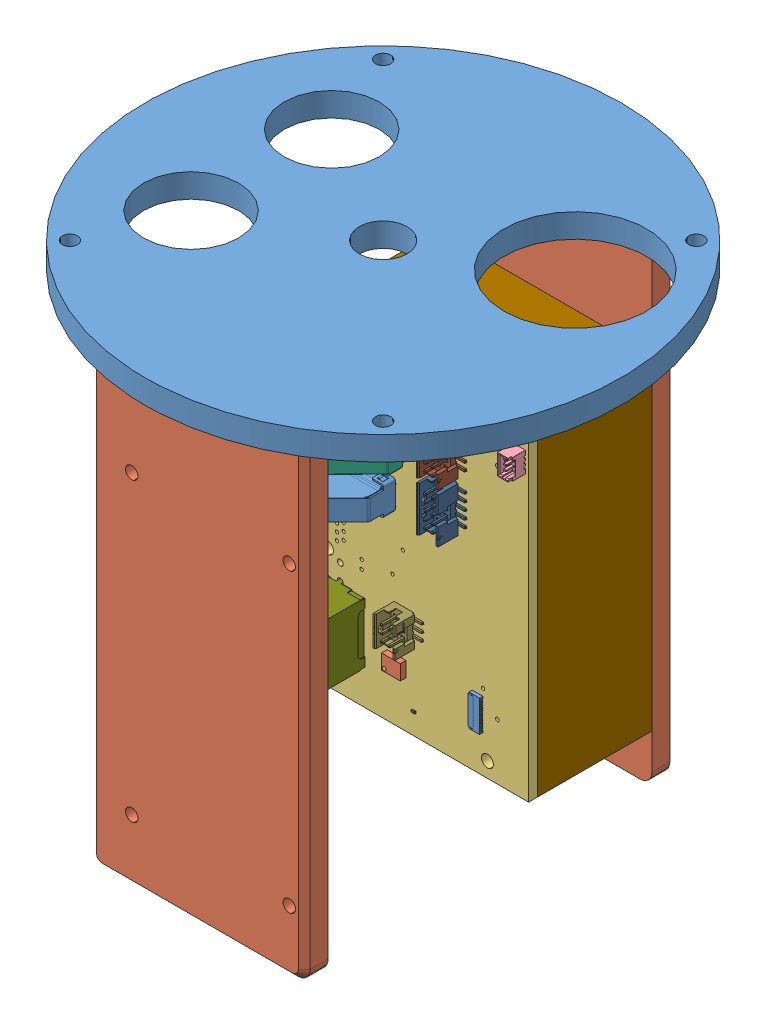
SolidWorks assembly HeatSinkFull.SLDASM, configuration Default (file format 10000). Lengths in mm.
Overall size (137.16 260.35 137.16).
563 component instances, 45 part files, 16 mates.
Components (placement in the parent):
- HeatSinkDisk-1: HeatSinkDisk.SLDPRT [Default] at (32.5539 67.51 103.619) size (127 6.35 127)
- HeatSinkPlate-1: HeatSinkPlate.SLDPRT [Default] at (61.0527 67.51 60.439) x (0 -1 0) z (1 0 0) size (127 28.58 57)
- TegraBlock-1: TegraBlock.SLDASM [Default] at (4.0551 40.21 93.3179) x (0 -1 0) z (0 0 1) size (87 59.91 49.32) (hidden)
  - Board-1: Board.sldprt [Default] at (0 0 -2.379) size (87 57 2.38)
  - P12-1: P12.sldasm [Default] at origin size (5.5 3.2 6.4)
    - 530470310-1: 530470310.sldasm [Default] at (8.8956 54.5264 2.1152) x (-1 0 0) z (0 0 1) size (5.5 3.2 6.4)
      - Open CASCADE STEP translator 6.8 2.2.1.1-1: Open CASCADE STEP translator 6.8 2.2.1.1.sldprt [Default] at origin size (5.5 3.2 6.4)
  - P1-1: P1.sldasm [Default] at origin size (60.02 7.11 13.27)
    - QTH-090-09-L-D-1: QTH-090-09-L-D.sldasm [Default] at (42.8171 50.6853 -2.5944) x (1 0 0) z (0 1 0) size (60.02 13.27 7.11)
      - _QTH-090-09-L-D_terminal-1: _QTH-090-09-L-D_terminal.sldprt [Default] x (-1 0 0) z (0 0 -1) size (60.02 7.06 5.97)
      - _T-1S60-09(-090-09-D)_pin-1: _T-1S60-09(-090-09-D)_pin.sldprt [Default] at (27.3558 -0.0762 -2.1209) x (0 0 -1) z (1 0 0) size (7.11 13.17 14.71)
      - _T-1S60-09(-090-09-D)_pin-2: _T-1S60-09(-090-09-D)_pin.sldprt [Default] at (7.3533 -0.0762 -2.1209) x (0 0 -1) z (1 0 0) size (7.11 13.17 14.71)
      - _T-1S60-09(-090-09-D)_pin-3: _T-1S60-09(-090-09-D)_pin.sldprt [Default] at (-12.6492 -0.0762 -2.1209) x (0 0 -1) z (1 0 0) size (7.11 13.17 14.71)
      - _T-1G1-09_imp-1: _T-1G1-09_imp.sldprt [Default] at (20.0089 0 0) x (-1 0 0) z (0 0 -1) size (18.92 12.76 0.38)
      - _T-1G1-09_imp-2: _T-1G1-09_imp.sldprt [Default] at (0.0064 0 0) x (-1 0 0) z (0 0 -1) size (18.92 12.76 0.38)
      - _T-1G1-09_imp-3: _T-1G1-09_imp.sldprt [Default] at (-19.9962 0 0) x (-1 0 0) z (0 0 -1) size (18.92 12.76 0.38)
      - _QTH-090-09-L-D_lower_terminal-1: _QTH-090-09-L-D_lower_terminal.sldprt [Default] x (-1 0 0) z (0 0 -1) size (60.02 3 6.73)
  - R8-1: R8.sldasm [Default] at origin size (3.5 2.5 0.64)
    - 565606688-1: 565606688.sldasm [Default] at (5.6608 15.6074 -3.014) size (3.5 2.5 0.64)
      - Extruded-1: Extruded.sldprt [Default] at origin size (3.5 2.5 0.64)
  - P10-1: P10.sldasm [Default] at origin size (12 9 6.45)
    - 98424g5210lf-1: 98424g5210lf.sldprt [Default] at (19.7112 36.271 0.6152) x (1 0 0) z (0 0 1) size (12 9 6.45)
  - P8-1: P8.sldasm [Default] at origin size (10 9 6.45)
    - s98424-x52-08LF-1: s98424-x52-08LF.sldprt [Default] at (8.5587 36.271 0.6152) x (1 0 0) z (0 0 1) size (10 9 6.45)
  - P7-1: P7.sldasm [Default] at origin size (8 9 6.45)
    - s98424-x52-06LF-1: s98424-x52-06LF.sldprt [Default] at (55.6497 24.7648 0.6152) x (1 0 0) z (0 0 1) size (8 9 6.45)
  - P4-1: P4.sldasm [Default] at origin size (10 9 6.45)
    - s98424-x52-08LF-1: s98424-x52-08LF.sldprt [Default] at (40.846 36.271 0.6152) x (1 0 0) z (0 0 1) size (10 9 6.45)
  - U1B-1: U1B.sldasm [Default] at origin size (2.2 1.35 1.1)
    - 565607968-1: 565607968.sldasm [Default] at (69.3836 16.8214 -3.479) size (2.2 1.35 1.1)
      - Extruded_2-1: Extruded_2.sldprt [Default] at origin size (2.2 1.35 1.1)
  - U1A-1: U1A.sldasm [Default] at origin size (2.2 1.35 1.1)
    - 565607968-1: 565607968.sldasm [Default] at (48.766 16.8214 -3.479) size (2.2 1.35 1.1)
      - Extruded_2-1: Extruded_2.sldprt [Default] at origin size (2.2 1.35 1.1)
  - R2B-1: R2B.sldasm [Default] at origin size (1.02 0.52 0.35)
    - 565605568-1: 565605568.sldasm [Default] at (72.9546 15.8214 -2.73) size (0.16 0.52 0.35)
      - Extruded_3-1: Extruded_3.sldprt [Default] at origin size (0.16 0.52 0.35)
    - 565605568-2: 565605568.sldasm [Default] at (73.8146 15.8214 -2.73) size (0.16 0.52 0.35)
      - Extruded_3-1: Extruded_3.sldprt [Default] at origin size (0.16 0.52 0.35)
    - 565605408-1: 565605408.sldasm [Default] at (73.3846 15.8214 -2.729) size (1 0.5 0.35)
      - Extruded_4-1: Extruded_4.sldprt [Default] at origin size (1 0.5 0.35)
  - R2A-1: R2A.sldasm [Default] at origin size (1.02 0.52 0.35)
    - 565605568-1: 565605568.sldasm [Default] at (52.337 15.8214 -2.73) size (0.16 0.52 0.35)
      - Extruded_3-1: Extruded_3.sldprt [Default] at origin size (0.16 0.52 0.35)
    - 565605568-2: 565605568.sldasm [Default] at (53.197 15.8214 -2.73) size (0.16 0.52 0.35)
      - Extruded_3-1: Extruded_3.sldprt [Default] at origin size (0.16 0.52 0.35)
    - 565605408-1: 565605408.sldasm [Default] at (52.767 15.8214 -2.729) size (1 0.5 0.35)
      - Extruded_4-1: Extruded_4.sldprt [Default] at origin size (1 0.5 0.35)
  - R1B-1: R1B.sldasm [Default] at origin size (1.02 0.52 0.35)
    - 565605568-1: 565605568.sldasm [Default] at (63.2846 15.8214 -2.73) size (0.16 0.52 0.35)
      - Extruded_3-1: Extruded_3.sldprt [Default] at origin size (0.16 0.52 0.35)
    - 565605568-2: 565605568.sldasm [Default] at (62.4246 15.8214 -2.73) size (0.16 0.52 0.35)
      - Extruded_3-1: Extruded_3.sldprt [Default] at origin size (0.16 0.52 0.35)
    - 565605408-1: 565605408.sldasm [Default] at (62.8546 15.8214 -2.729) size (1 0.5 0.35)
      - Extruded_4-1: Extruded_4.sldprt [Default] at origin size (1 0.5 0.35)
  - R1A-1: R1A.sldasm [Default] at origin size (1.02 0.52 0.35)
    - 565605568-1: 565605568.sldasm [Default] at (42.667 15.8214 -2.73) size (0.16 0.52 0.35)
      - Extruded_3-1: Extruded_3.sldprt [Default] at origin size (0.16 0.52 0.35)
    - 565605568-2: 565605568.sldasm [Default] at (41.807 15.8214 -2.73) size (0.16 0.52 0.35)
      - Extruded_3-1: Extruded_3.sldprt [Default] at origin size (0.16 0.52 0.35)
    - 565605408-1: 565605408.sldasm [Default] at (42.237 15.8214 -2.729) size (1 0.5 0.35)
      - Extruded_4-1: Extruded_4.sldprt [Default] at origin size (1 0.5 0.35)
  - P3B-1: P3B.sldasm [Default] at origin size (18.65 16.72 18.72)
    - c-2-406549-1-r4-3d-1: c-2-406549-1-r4-3d.sldprt [Default] at (69.2586 -1.9361 6.8097) x (1 0 0) z (0 -1 0) size (18.65 18.72 16.72)
  - P3A-1: P3A.sldasm [Default] at origin size (18.65 16.72 18.72)
    - c-2-406549-1-r4-3d-1: c-2-406549-1-r4-3d.sldprt [Default] at (48.641 -1.9361 6.8097) x (1 0 0) z (0 -1 0) size (18.65 18.72 16.72)
  - D1-1: D1.sldasm [Default] at origin size (1.95 1.5 1.15)
    - 565607808-1: 565607808.sldasm [Default] at (5.1301 38.4169 -3.529) size (1.95 1.5 1.15)
      - Extruded_5-1: Extruded_5.sldprt [Default] at origin size (1.95 1.5 1.15)
  - D2-1: D2.sldasm [Default] at origin size (2.6 5.21 2.43)
    - User_Library-DO-214AC_SMA-1: User_Library-DO-214AC_SMA.sldprt [Default] at (4.8544 22.2548 -3.7942) x (-1 0 0) z (0 0 -1) size (2.6 5.21 2.43)
  - P2-1: P2.sldasm [Default] at origin size (7.88 23.1 20.15)
    - c-2007435-3-c-3d-1: c-2007435-3-c-3d.sldprt [Default] at (33.2496 -1.0145 9.0122) x (1 0 0) z (0 -1 0) size (7.88 20.15 23.1)
  - Q1-1: Q1.sldasm [Default] at origin size (6.7 7.2 3)
    - 565607488-1: 565607488.sldasm [Default] at (5.1128 26.7739 -3.379) size (5.4 1.25 1)
      - Extruded_6-1: Extruded_6.sldprt [Default] at origin size (5.4 1.25 1)
    - 565607648-1: 565607648.sldasm [Default] at (5.0628 30.3989 -5.379) size (6.7 5.9 3)
      - Extruded_7-1: Extruded_7.sldprt [Default] at origin size (6.7 5.9 3)
  - R3-1: R3.sldasm [Default] at origin size (0.9 1.6 0.46)
    - 565606208-1: 565606208.sldasm [Default] at (2.4506 38.5217 -2.839) size (0.9 0.3 0.46)
      - Extruded_8-1: Extruded_8.sldprt [Default] at origin size (0.9 0.3 0.46)
    - 565606208-2: 565606208.sldasm [Default] at (2.4506 39.8217 -2.839) size (0.9 0.3 0.46)
      - Extruded_8-1: Extruded_8.sldprt [Default] at origin size (0.9 0.3 0.46)
    - 565606048-1: 565606048.sldasm [Default] at (2.4506 39.1717 -2.829) size (0.9 1 0.45)
      - Extruded_9-1: Extruded_9.sldprt [Default] at origin size (0.9 1 0.45)
  - P9-1: P9.sldasm [Default] at origin (suppressed, hidden)
  - P6-1: P6.sldasm [Default] at origin size (7.33 25.71 18.21)
    - 484040003-1: 484040003.sldasm [Default] at (22.5333 9.6965 10.8) x (0 1 0) z (1 0 0) size (25.71 18.21 7.33)
      - Open CASCADE STEP translator 6.8 2.23.1.1-1: Open CASCADE STEP translator 6.8 2.23.1.1.sldprt [Default] at origin size (25.71 18.21 7.33)
  - J1-1: J1.sldasm [Default] at origin size (12 9 6.45)
    - 98424g5210lf-1: 98424g5210lf.sldprt [Default] at (51.6572 36.271 0.6152) x (1 0 0) z (0 0 1) size (12 9 6.45)
  - P5-1: P5.sldasm [Default] at origin size (7 13.69 17.88)
    - 673298000-1: 673298000.sldasm [Default] at (12.2691 6.0209 7.3623) x (0 1 0) z (1 0 0) size (13.69 17.88 7)
      - Open CASCADE STEP translator 6.8 2.25.1.1-1: Open CASCADE STEP translator 6.8 2.25.1.1.sldprt [Default] at origin size (13.69 17.88 7)
  - F1-1: F1.sldasm [Default] at origin size (3.2 4.6 0.7)
    - 565607168-1: 565607168.sldasm [Default] at (45.3347 35.478 -3.079) size (3.2 0.3 0.7)
      - Extruded_10-1: Extruded_10.sldprt [Default] at origin size (3.2 0.3 0.7)
    - 565607168-2: 565607168.sldasm [Default] at (45.3347 39.778 -3.079) size (3.2 0.3 0.7)
      - Extruded_10-1: Extruded_10.sldprt [Default] at origin size (3.2 0.3 0.7)
    - 565607328-1: 565607328.sldasm [Default] at (45.3347 37.628 -3.079) size (3.2 4 0.7)
      - Extruded_11-1: Extruded_11.sldprt [Default] at origin size (3.2 4 0.7)
  - U2-1: U2.sldasm [Default] at origin size (15 11.25 2.92)
    - 565604288-1: 565604288.sldasm [Default] at (76.8267 30.2737 -5.299) size (15 11.25 2.92)
      - Extruded_12-1: Extruded_12.sldprt [Default] at origin size (15 11.25 2.92)
  - C2-1: C2.sldasm [Default] at origin size (3.52 2.72 2.51)
    - 565606848-1: 565606848.sldasm [Default] at (74.9217 38.5287 -4.879) size (3.5 2.7 2.5)
      - Extruded_13-1: Extruded_13.sldprt [Default] at origin size (3.5 2.7 2.5)
    - 565607008-1: 565607008.sldasm [Default] at (76.4767 38.5287 -4.889) size (0.41 2.72 2.51)
      - Extruded_14-1: Extruded_14.sldprt [Default] at origin size (0.41 2.72 2.51)
    - 565607008-2: 565607008.sldasm [Default] at (73.3667 38.5287 -4.889) size (0.41 2.72 2.51)
      - Extruded_14-1: Extruded_14.sldprt [Default] at origin size (0.41 2.72 2.51)
  - C1-1: C1.sldasm [Default] at origin size (3.5 2.5 0.64)
    - 565606688-1: 565606688.sldasm [Default] at (80.0017 38.5287 -3.014) size (3.5 2.5 0.64)
      - Extruded-1: Extruded.sldprt [Default] at origin size (3.5 2.5 0.64)
  - C3-1: C3.sldasm [Default] at origin size (6.3 7.5 3.81)
    - 565606368-1: 565606368.sldasm [Default] at (65.0792 30.2737 -6.179) size (6.3 7.5 3.8)
      - Extruded_15-1: Extruded_15.sldprt [Default] at origin size (6.3 7.5 3.8)
    - 565606528-1: 565606528.sldasm [Default] at (65.0792 33.2737 -6.189) size (6.2 0.4 3.81)
      - Extruded_16-1: Extruded_16.sldprt [Default] at origin size (6.2 0.4 3.81)
  - R6-1: R6.sldasm [Default] at origin size (0.52 1.02 0.35)
    - 565605088-1: 565605088.sldasm [Default] at (81.2717 26.8937 0) size (0.52 0.16 0.35)
      - Extruded_17-1: Extruded_17.sldprt [Default] at origin size (0.52 0.16 0.35)
    - 565605088-2: 565605088.sldasm [Default] at (81.2717 26.0337 0) size (0.52 0.16 0.35)
      - Extruded_17-1: Extruded_17.sldprt [Default] at origin size (0.52 0.16 0.35)
    - 565604928-1: 565604928.sldasm [Default] at (81.2717 26.4637 0) size (0.5 1 0.35)
      - Extruded_18-1: Extruded_18.sldprt [Default] at origin size (0.5 1 0.35)
  - R4-1: R4.sldasm [Default] at origin size (0.52 1.02 0.35)
    - 565605088-1: 565605088.sldasm [Default] at (82.5417 28.5737 0) size (0.52 0.16 0.35)
      - Extruded_17-1: Extruded_17.sldprt [Default] at origin size (0.52 0.16 0.35)
    - 565605088-2: 565605088.sldasm [Default] at (82.5417 29.4337 0) size (0.52 0.16 0.35)
      - Extruded_17-1: Extruded_17.sldprt [Default] at origin size (0.52 0.16 0.35)
    - 565604928-1: 565604928.sldasm [Default] at (82.5417 29.0037 0) size (0.5 1 0.35)
      - Extruded_18-1: Extruded_18.sldprt [Default] at origin size (0.5 1 0.35)
  - C4-1: C4.sldasm [Default] at origin size (0.52 1.02 0.35)
    - 565604928-1: 565604928.sldasm [Default] at (80.0017 26.4637 0) size (0.5 1 0.35)
      - Extruded_18-1: Extruded_18.sldprt [Default] at origin size (0.5 1 0.35)
    - 565605088-1: 565605088.sldasm [Default] at (80.0017 26.8937 0) size (0.52 0.16 0.35)
      - Extruded_17-1: Extruded_17.sldprt [Default] at origin size (0.52 0.16 0.35)
    - 565605088-2: 565605088.sldasm [Default] at (80.0017 26.0337 0) size (0.52 0.16 0.35)
      - Extruded_17-1: Extruded_17.sldprt [Default] at origin size (0.52 0.16 0.35)
  - R5-1: R5.sldasm [Default] at origin size (0.52 1.02 0.35)
    - 565604928-1: 565604928.sldasm [Default] at (78.7317 26.4637 0) size (0.5 1 0.35)
      - Extruded_18-1: Extruded_18.sldprt [Default] at origin size (0.5 1 0.35)
    - 565605088-1: 565605088.sldasm [Default] at (78.7317 26.0337 0) size (0.52 0.16 0.35)
      - Extruded_17-1: Extruded_17.sldprt [Default] at origin size (0.52 0.16 0.35)
    - 565605088-2: 565605088.sldasm [Default] at (78.7317 26.8937 0) size (0.52 0.16 0.35)
      - Extruded_17-1: Extruded_17.sldprt [Default] at origin size (0.52 0.16 0.35)
  - C5-1: C5.sldasm [Default] at origin size (1.6 0.9 0.46)
    - 565605728-1: 565605728.sldasm [Default] at (75.946 51.3842 -2.829) size (1 0.9 0.45)
      - Extruded_19-1: Extruded_19.sldprt [Default] at origin size (1 0.9 0.45)
    - 565605888-1: 565605888.sldasm [Default] at (75.296 51.3842 -2.839) size (0.3 0.9 0.46)
      - Extruded_20-1: Extruded_20.sldprt [Default] at origin size (0.3 0.9 0.46)
    - 565605888-2: 565605888.sldasm [Default] at (76.596 51.3842 -2.839) size (0.3 0.9 0.46)
      - Extruded_20-1: Extruded_20.sldprt [Default] at origin size (0.3 0.9 0.46)
  - C6-1: C6.sldasm [Default] at origin size (1.6 0.9 0.46)
    - 565605728-1: 565605728.sldasm [Default] at (75.946 49.8348 -2.829) size (1 0.9 0.45)
      - Extruded_19-1: Extruded_19.sldprt [Default] at origin size (1 0.9 0.45)
    - 565605888-1: 565605888.sldasm [Default] at (75.296 49.8348 -2.839) size (0.3 0.9 0.46)
      - Extruded_20-1: Extruded_20.sldprt [Default] at origin size (0.3 0.9 0.46)
    - 565605888-2: 565605888.sldasm [Default] at (76.596 49.8348 -2.839) size (0.3 0.9 0.46)
      - Extruded_20-1: Extruded_20.sldprt [Default] at origin size (0.3 0.9 0.46)
  - C7-1: C7.sldasm [Default] at origin size (1.6 0.9 0.46)
    - 565605728-1: 565605728.sldasm [Default] at (75.946 48.2854 -2.829) size (1 0.9 0.45)
      - Extruded_19-1: Extruded_19.sldprt [Default] at origin size (1 0.9 0.45)
    - 565605888-1: 565605888.sldasm [Default] at (75.296 48.2854 -2.839) size (0.3 0.9 0.46)
      - Extruded_20-1: Extruded_20.sldprt [Default] at origin size (0.3 0.9 0.46)
    - 565605888-2: 565605888.sldasm [Default] at (76.596 48.2854 -2.839) size (0.3 0.9 0.46)
      - Extruded_20-1: Extruded_20.sldprt [Default] at origin size (0.3 0.9 0.46)
  - C8-1: C8.sldasm [Default] at origin size (0.9 1.6 0.46)
    - 565606048-1: 565606048.sldasm [Default] at (66.929 37.5158 -2.829) size (0.9 1 0.45)
      - Extruded_9-1: Extruded_9.sldprt [Default] at origin size (0.9 1 0.45)
    - 565606208-1: 565606208.sldasm [Default] at (66.929 38.1658 -2.839) size (0.9 0.3 0.46)
      - Extruded_8-1: Extruded_8.sldprt [Default] at origin size (0.9 0.3 0.46)
    - 565606208-2: 565606208.sldasm [Default] at (66.929 36.8658 -2.839) size (0.9 0.3 0.46)
      - Extruded_8-1: Extruded_8.sldprt [Default] at origin size (0.9 0.3 0.46)
  - C9-1: C9.sldasm [Default] at origin size (0.9 1.6 0.46)
    - 565606048-1: 565606048.sldasm [Default] at (65.3542 37.5158 -2.829) size (0.9 1 0.45)
      - Extruded_9-1: Extruded_9.sldprt [Default] at origin size (0.9 1 0.45)
    - 565606208-1: 565606208.sldasm [Default] at (65.3542 38.1658 -2.839) size (0.9 0.3 0.46)
      - Extruded_8-1: Extruded_8.sldprt [Default] at origin size (0.9 0.3 0.46)
    - 565606208-2: 565606208.sldasm [Default] at (65.3542 36.8658 -2.839) size (0.9 0.3 0.46)
      - Extruded_8-1: Extruded_8.sldprt [Default] at origin size (0.9 0.3 0.46)
  - C10-1: C10.sldasm [Default] at origin size (1.6 0.9 0.46)
    - 565605728-1: 565605728.sldasm [Default] at (81.6442 9.3353 -2.829) size (1 0.9 0.45)
      - Extruded_19-1: Extruded_19.sldprt [Default] at origin size (1 0.9 0.45)
    - 565605888-1: 565605888.sldasm [Default] at (80.9942 9.3353 -2.839) size (0.3 0.9 0.46)
      - Extruded_20-1: Extruded_20.sldprt [Default] at origin size (0.3 0.9 0.46)
    - 565605888-2: 565605888.sldasm [Default] at (82.2942 9.3353 -2.839) size (0.3 0.9 0.46)
      - Extruded_20-1: Extruded_20.sldprt [Default] at origin size (0.3 0.9 0.46)
  - C11-1: C11.sldasm [Default] at origin size (1.6 0.9 0.46)
    - 565605728-1: 565605728.sldasm [Default] at (82.03 18.6944 -2.829) size (1 0.9 0.45)
      - Extruded_19-1: Extruded_19.sldprt [Default] at origin size (1 0.9 0.45)
    - 565605888-1: 565605888.sldasm [Default] at (81.38 18.6944 -2.839) size (0.3 0.9 0.46)
      - Extruded_20-1: Extruded_20.sldprt [Default] at origin size (0.3 0.9 0.46)
    - 565605888-2: 565605888.sldasm [Default] at (82.68 18.6944 -2.839) size (0.3 0.9 0.46)
      - Extruded_20-1: Extruded_20.sldprt [Default] at origin size (0.3 0.9 0.46)
  - C12-1: C12.sldasm [Default] at origin size (1.02 0.52 0.35)
    - 565605408-1: 565605408.sldasm [Default] at (81.5522 10.5972 -2.729) size (1 0.5 0.35)
      - Extruded_4-1: Extruded_4.sldprt [Default] at origin size (1 0.5 0.35)
    - 565605568-1: 565605568.sldasm [Default] at (81.9822 10.5972 -2.73) size (0.16 0.52 0.35)
      - Extruded_3-1: Extruded_3.sldprt [Default] at origin size (0.16 0.52 0.35)
    - 565605568-2: 565605568.sldasm [Default] at (81.1222 10.5972 -2.73) size (0.16 0.52 0.35)
      - Extruded_3-1: Extruded_3.sldprt [Default] at origin size (0.16 0.52 0.35)
  - P11-1: P11.sldasm [Default] at origin size (8.4 3.15 0.9)
    - ayf332335-closed-1: ayf332335-closed.sldprt [Default] at (72.8265 43.2591 0) x (-1 0 0) z (0 1 0) size (8.4 0.9 3.15)
  - R7-1: R7.sldasm [Default] at origin size (1.02 0.52 0.35)
    - 565605408-1: 565605408.sldasm [Default] at (84.0863 23.7309 0) size (1 0.5 0.35)
      - Extruded_4-1: Extruded_4.sldprt [Default] at origin size (1 0.5 0.35)
    - 565605568-1: 565605568.sldasm [Default] at (84.5163 23.7309 0) size (0.16 0.52 0.35)
      - Extruded_3-1: Extruded_3.sldprt [Default] at origin size (0.16 0.52 0.35)
    - 565605568-2: 565605568.sldasm [Default] at (83.6563 23.7309 0) size (0.16 0.52 0.35)
      - Extruded_3-1: Extruded_3.sldprt [Default] at origin size (0.16 0.52 0.35)
  - R9-1: R9.sldasm [Default] at origin size (1.02 0.52 0.35)
    - 565605408-1: 565605408.sldasm [Default] at (81.0379 23.7309 0) size (1 0.5 0.35)
      - Extruded_4-1: Extruded_4.sldprt [Default] at origin size (1 0.5 0.35)
    - 565605568-1: 565605568.sldasm [Default] at (81.468 23.7309 0) size (0.16 0.52 0.35)
      - Extruded_3-1: Extruded_3.sldprt [Default] at origin size (0.16 0.52 0.35)
    - 565605568-2: 565605568.sldasm [Default] at (80.608 23.7309 0) size (0.16 0.52 0.35)
      - Extruded_3-1: Extruded_3.sldprt [Default] at origin size (0.16 0.52 0.35)
  - R10-1: R10.sldasm [Default] at origin size (1.02 0.52 0.35)
    - 565605408-1: 565605408.sldasm [Default] at (77.9697 23.7309 0) size (1 0.5 0.35)
      - Extruded_4-1: Extruded_4.sldprt [Default] at origin size (1 0.5 0.35)
    - 565605568-1: 565605568.sldasm [Default] at (78.3997 23.7309 0) size (0.16 0.52 0.35)
      - Extruded_3-1: Extruded_3.sldprt [Default] at origin size (0.16 0.52 0.35)
    - 565605568-2: 565605568.sldasm [Default] at (77.5397 23.7309 0) size (0.16 0.52 0.35)
      - Extruded_3-1: Extruded_3.sldprt [Default] at origin size (0.16 0.52 0.35)
  - R11-1: R11.sldasm [Default] at origin size (1.02 0.52 0.35)
    - 565605408-1: 565605408.sldasm [Default] at (84.0863 22.6537 0) size (1 0.5 0.35)
      - Extruded_4-1: Extruded_4.sldprt [Default] at origin size (1 0.5 0.35)
    - 565605568-1: 565605568.sldasm [Default] at (83.6563 22.6537 0) size (0.16 0.52 0.35)
      - Extruded_3-1: Extruded_3.sldprt [Default] at origin size (0.16 0.52 0.35)
    - 565605568-2: 565605568.sldasm [Default] at (84.5163 22.6537 0) size (0.16 0.52 0.35)
      - Extruded_3-1: Extruded_3.sldprt [Default] at origin size (0.16 0.52 0.35)
  - R12-1: R12.sldasm [Default] at origin size (1.02 0.52 0.35)
    - 565605408-1: 565605408.sldasm [Default] at (81.0379 22.6537 0) size (1 0.5 0.35)
      - Extruded_4-1: Extruded_4.sldprt [Default] at origin size (1 0.5 0.35)
    - 565605568-1: 565605568.sldasm [Default] at (80.608 22.6537 0) size (0.16 0.52 0.35)
      - Extruded_3-1: Extruded_3.sldprt [Default] at origin size (0.16 0.52 0.35)
    - 565605568-2: 565605568.sldasm [Default] at (81.468 22.6537 0) size (0.16 0.52 0.35)
      - Extruded_3-1: Extruded_3.sldprt [Default] at origin size (0.16 0.52 0.35)
  - R13-1: R13.sldasm [Default] at origin size (1.02 0.52 0.35)
    - 565605408-1: 565605408.sldasm [Default] at (77.9697 22.6537 0) size (1 0.5 0.35)
      - Extruded_4-1: Extruded_4.sldprt [Default] at origin size (1 0.5 0.35)
    - 565605568-1: 565605568.sldasm [Default] at (77.5397 22.6537 0) size (0.16 0.52 0.35)
      - Extruded_3-1: Extruded_3.sldprt [Default] at origin size (0.16 0.52 0.35)
    - 565605568-2: 565605568.sldasm [Default] at (78.3997 22.6537 0) size (0.16 0.52 0.35)
      - Extruded_3-1: Extruded_3.sldprt [Default] at origin size (0.16 0.52 0.35)
  - R14-1: R14.sldasm [Default] at origin size (1.02 0.52 0.35)
    - 565605408-1: 565605408.sldasm [Default] at (83.762 20.0352 -2.729) size (1 0.5 0.35)
      - Extruded_4-1: Extruded_4.sldprt [Default] at origin size (1 0.5 0.35)
    - 565605568-1: 565605568.sldasm [Default] at (83.332 20.0352 -2.73) size (0.16 0.52 0.35)
      - Extruded_3-1: Extruded_3.sldprt [Default] at origin size (0.16 0.52 0.35)
    - 565605568-2: 565605568.sldasm [Default] at (84.192 20.0352 -2.73) size (0.16 0.52 0.35)
      - Extruded_3-1: Extruded_3.sldprt [Default] at origin size (0.16 0.52 0.35)
  - U3-1: U3.sldasm [Default] at origin size (4 5 1.51)
    - 565608128-1: 565608128.sldasm [Default] at (72.3969 22.0188 0.25) size (4 5 1.5)
      - Extruded_21-1: Extruded_21.sldprt [Default] at origin size (4 5 1.5)
    - 569598016-1: 569598016.sldasm [Default] at (73.696 20.2167 0.25) x (0 1 0) z (0 0 1) size (1 1 1.51)
      - Cylinder-1: Cylinder.sldprt [Default] at origin size (1 1 1.51)
  - U5-1: U5.sldasm [Default] at origin size (5 5 0.76)
    - 565605248-1: 565605248.sldasm [Default] at (81.4832 14.4018 -3.129) size (5 5 0.7)
      - Extruded_22-1: Extruded_22.sldprt [Default] at origin size (5 5 0.7)
    - 569598624-1: 569598624.sldasm [Default] at (79.5838 16.3042 -2.379) x (0 -1 0) z (0 0 -1) size (0.6 0.6 0.76)
      - Cylinder_2-1: Cylinder_2.sldprt [Default] at origin size (0.6 0.6 0.76)
  - R15-1: R15.sldasm [Default] at origin size (0.52 1.02 0.35)
    - 565604928-1: 565604928.sldasm [Default] at (85.3132 19.6088 -2.729) size (0.5 1 0.35)
      - Extruded_18-1: Extruded_18.sldprt [Default] at origin size (0.5 1 0.35)
    - 565605088-1: 565605088.sldasm [Default] at (85.3132 20.0388 -2.73) size (0.52 0.16 0.35)
      - Extruded_17-1: Extruded_17.sldprt [Default] at origin size (0.52 0.16 0.35)
    - 565605088-2: 565605088.sldasm [Default] at (85.3132 19.1788 -2.73) size (0.52 0.16 0.35)
      - Extruded_17-1: Extruded_17.sldprt [Default] at origin size (0.52 0.16 0.35)
  - D3-1: D3.sldasm [Default] at origin size (4.1 1.7 0.65)
    - 565604768-1: 565604768.sldasm [Default] at (71.8464 43.4033 -3.029) size (4.1 1.7 0.65)
      - Extruded_23-1: Extruded_23.sldprt [Default] at origin size (4.1 1.7 0.65)
  - D4-1: D4.sldasm [Default] at origin size (1.1 0.7 0.55)
    - 565604608-1: 565604608.sldasm [Default] at (75.946 52.7812 -2.929) size (1.1 0.7 0.55)
      - Extruded_24-1: Extruded_24.sldprt [Default] at origin size (1.1 0.7 0.55)
  - D5-1: D5.sldasm [Default] at origin size (0.7 1.1 0.55)
    - 565604448-1: 565604448.sldasm [Default] at (68.2752 37.592 -2.929) size (0.7 1.1 0.55)
      - Extruded_25-1: Extruded_25.sldprt [Default] at origin size (0.7 1.1 0.55)
  - Free-Models-1: Free-Models.sldasm [Default] at origin (suppressed, hidden)
  - bottom mock up-1: bottom mock up.SLDPRT [Default] at (87 0 -2.379) x (0 -1 0) z (1 0 0) size (57 30.5 87)
- HeatSinkPlate-2: HeatSinkPlate.SLDPRT [Default] at (4.0551 67.51 146.799) x (0 -1 0) z (-1 0 0) size (127 28.58 57)
- TegraBlock-2: TegraBlock.SLDASM [Default] at (61.0527 40.21 113.92) x (0 -1 0) z (0 0 -1) size (87 59.91 49.32) (hidden)
  - Board-1: Board.sldprt [Default] at (0 0 -2.379) size (87 57 2.38)
  - P12-1: P12.sldasm [Default] at origin size (5.5 3.2 6.4)
    - 530470310-1: 530470310.sldasm [Default] at (8.8956 54.5264 2.1152) x (-1 0 0) z (0 0 1) size (5.5 3.2 6.4)
      - Open CASCADE STEP translator 6.8 2.2.1.1-1: Open CASCADE STEP translator 6.8 2.2.1.1.sldprt [Default] at origin size (5.5 3.2 6.4)
  - P1-1: P1.sldasm [Default] at origin size (60.02 7.11 13.27)
    - QTH-090-09-L-D-1: QTH-090-09-L-D.sldasm [Default] at (42.8171 50.6853 -2.5944) x (1 0 0) z (0 1 0) size (60.02 13.27 7.11)
      - _QTH-090-09-L-D_terminal-1: _QTH-090-09-L-D_terminal.sldprt [Default] x (-1 0 0) z (0 0 -1) size (60.02 7.06 5.97)
      - _T-1S60-09(-090-09-D)_pin-1: _T-1S60-09(-090-09-D)_pin.sldprt [Default] at (27.3558 -0.0762 -2.1209) x (0 0 -1) z (1 0 0) size (7.11 13.17 14.71)
      - _T-1S60-09(-090-09-D)_pin-2: _T-1S60-09(-090-09-D)_pin.sldprt [Default] at (7.3533 -0.0762 -2.1209) x (0 0 -1) z (1 0 0) size (7.11 13.17 14.71)
      - _T-1S60-09(-090-09-D)_pin-3: _T-1S60-09(-090-09-D)_pin.sldprt [Default] at (-12.6492 -0.0762 -2.1209) x (0 0 -1) z (1 0 0) size (7.11 13.17 14.71)
      - _T-1G1-09_imp-1: _T-1G1-09_imp.sldprt [Default] at (20.0089 0 0) x (-1 0 0) z (0 0 -1) size (18.92 12.76 0.38)
      - _T-1G1-09_imp-2: _T-1G1-09_imp.sldprt [Default] at (0.0064 0 0) x (-1 0 0) z (0 0 -1) size (18.92 12.76 0.38)
      - _T-1G1-09_imp-3: _T-1G1-09_imp.sldprt [Default] at (-19.9962 0 0) x (-1 0 0) z (0 0 -1) size (18.92 12.76 0.38)
      - _QTH-090-09-L-D_lower_terminal-1: _QTH-090-09-L-D_lower_terminal.sldprt [Default] x (-1 0 0) z (0 0 -1) size (60.02 3 6.73)
  - R8-1: R8.sldasm [Default] at origin size (3.5 2.5 0.64)
    - 565606688-1: 565606688.sldasm [Default] at (5.6608 15.6074 -3.014) size (3.5 2.5 0.64)
      - Extruded-1: Extruded.sldprt [Default] at origin size (3.5 2.5 0.64)
  - P10-1: P10.sldasm [Default] at origin size (12 9 6.45)
    - 98424g5210lf-1: 98424g5210lf.sldprt [Default] at (19.7112 36.271 0.6152) x (1 0 0) z (0 0 1) size (12 9 6.45)
  - P8-1: P8.sldasm [Default] at origin size (10 9 6.45)
    - s98424-x52-08LF-1: s98424-x52-08LF.sldprt [Default] at (8.5587 36.271 0.6152) x (1 0 0) z (0 0 1) size (10 9 6.45)
  - P7-1: P7.sldasm [Default] at origin size (8 9 6.45)
    - s98424-x52-06LF-1: s98424-x52-06LF.sldprt [Default] at (55.6497 24.7648 0.6152) x (1 0 0) z (0 0 1) size (8 9 6.45)
  - P4-1: P4.sldasm [Default] at origin size (10 9 6.45)
    - s98424-x52-08LF-1: s98424-x52-08LF.sldprt [Default] at (40.846 36.271 0.6152) x (1 0 0) z (0 0 1) size (10 9 6.45)
  - U1B-1: U1B.sldasm [Default] at origin size (2.2 1.35 1.1)
    - 565607968-1: 565607968.sldasm [Default] at (69.3836 16.8214 -3.479) size (2.2 1.35 1.1)
      - Extruded_2-1: Extruded_2.sldprt [Default] at origin size (2.2 1.35 1.1)
  - U1A-1: U1A.sldasm [Default] at origin size (2.2 1.35 1.1)
    - 565607968-1: 565607968.sldasm [Default] at (48.766 16.8214 -3.479) size (2.2 1.35 1.1)
      - Extruded_2-1: Extruded_2.sldprt [Default] at origin size (2.2 1.35 1.1)
  - R2B-1: R2B.sldasm [Default] at origin size (1.02 0.52 0.35)
    - 565605568-1: 565605568.sldasm [Default] at (72.9546 15.8214 -2.73) size (0.16 0.52 0.35)
      - Extruded_3-1: Extruded_3.sldprt [Default] at origin size (0.16 0.52 0.35)
    - 565605568-2: 565605568.sldasm [Default] at (73.8146 15.8214 -2.73) size (0.16 0.52 0.35)
      - Extruded_3-1: Extruded_3.sldprt [Default] at origin size (0.16 0.52 0.35)
    - 565605408-1: 565605408.sldasm [Default] at (73.3846 15.8214 -2.729) size (1 0.5 0.35)
      - Extruded_4-1: Extruded_4.sldprt [Default] at origin size (1 0.5 0.35)
  - R2A-1: R2A.sldasm [Default] at origin size (1.02 0.52 0.35)
    - 565605568-1: 565605568.sldasm [Default] at (52.337 15.8214 -2.73) size (0.16 0.52 0.35)
      - Extruded_3-1: Extruded_3.sldprt [Default] at origin size (0.16 0.52 0.35)
    - 565605568-2: 565605568.sldasm [Default] at (53.197 15.8214 -2.73) size (0.16 0.52 0.35)
      - Extruded_3-1: Extruded_3.sldprt [Default] at origin size (0.16 0.52 0.35)
    - 565605408-1: 565605408.sldasm [Default] at (52.767 15.8214 -2.729) size (1 0.5 0.35)
      - Extruded_4-1: Extruded_4.sldprt [Default] at origin size (1 0.5 0.35)
  - R1B-1: R1B.sldasm [Default] at origin size (1.02 0.52 0.35)
    - 565605568-1: 565605568.sldasm [Default] at (63.2846 15.8214 -2.73) size (0.16 0.52 0.35)
      - Extruded_3-1: Extruded_3.sldprt [Default] at origin size (0.16 0.52 0.35)
    - 565605568-2: 565605568.sldasm [Default] at (62.4246 15.8214 -2.73) size (0.16 0.52 0.35)
      - Extruded_3-1: Extruded_3.sldprt [Default] at origin size (0.16 0.52 0.35)
    - 565605408-1: 565605408.sldasm [Default] at (62.8546 15.8214 -2.729) size (1 0.5 0.35)
      - Extruded_4-1: Extruded_4.sldprt [Default] at origin size (1 0.5 0.35)
  - R1A-1: R1A.sldasm [Default] at origin size (1.02 0.52 0.35)
    - 565605568-1: 565605568.sldasm [Default] at (42.667 15.8214 -2.73) size (0.16 0.52 0.35)
      - Extruded_3-1: Extruded_3.sldprt [Default] at origin size (0.16 0.52 0.35)
    - 565605568-2: 565605568.sldasm [Default] at (41.807 15.8214 -2.73) size (0.16 0.52 0.35)
      - Extruded_3-1: Extruded_3.sldprt [Default] at origin size (0.16 0.52 0.35)
    - 565605408-1: 565605408.sldasm [Default] at (42.237 15.8214 -2.729) size (1 0.5 0.35)
      - Extruded_4-1: Extruded_4.sldprt [Default] at origin size (1 0.5 0.35)
  - P3B-1: P3B.sldasm [Default] at origin size (18.65 16.72 18.72)
    - c-2-406549-1-r4-3d-1: c-2-406549-1-r4-3d.sldprt [Default] at (69.2586 -1.9361 6.8097) x (1 0 0) z (0 -1 0) size (18.65 18.72 16.72)
  - P3A-1: P3A.sldasm [Default] at origin size (18.65 16.72 18.72)
    - c-2-406549-1-r4-3d-1: c-2-406549-1-r4-3d.sldprt [Default] at (48.641 -1.9361 6.8097) x (1 0 0) z (0 -1 0) size (18.65 18.72 16.72)
  - D1-1: D1.sldasm [Default] at origin size (1.95 1.5 1.15)
    - 565607808-1: 565607808.sldasm [Default] at (5.1301 38.4169 -3.529) size (1.95 1.5 1.15)
      - Extruded_5-1: Extruded_5.sldprt [Default] at origin size (1.95 1.5 1.15)
  - D2-1: D2.sldasm [Default] at origin size (2.6 5.21 2.43)
    - User_Library-DO-214AC_SMA-1: User_Library-DO-214AC_SMA.sldprt [Default] at (4.8544 22.2548 -3.7942) x (-1 0 0) z (0 0 -1) size (2.6 5.21 2.43)
  - P2-1: P2.sldasm [Default] at origin size (7.88 23.1 20.15)
    - c-2007435-3-c-3d-1: c-2007435-3-c-3d.sldprt [Default] at (33.2496 -1.0145 9.0122) x (1 0 0) z (0 -1 0) size (7.88 20.15 23.1)
  - Q1-1: Q1.sldasm [Default] at origin size (6.7 7.2 3)
    - 565607488-1: 565607488.sldasm [Default] at (5.1128 26.7739 -3.379) size (5.4 1.25 1)
      - Extruded_6-1: Extruded_6.sldprt [Default] at origin size (5.4 1.25 1)
    - 565607648-1: 565607648.sldasm [Default] at (5.0628 30.3989 -5.379) size (6.7 5.9 3)
      - Extruded_7-1: Extruded_7.sldprt [Default] at origin size (6.7 5.9 3)
  - R3-1: R3.sldasm [Default] at origin size (0.9 1.6 0.46)
    - 565606208-1: 565606208.sldasm [Default] at (2.4506 38.5217 -2.839) size (0.9 0.3 0.46)
      - Extruded_8-1: Extruded_8.sldprt [Default] at origin size (0.9 0.3 0.46)
    - 565606208-2: 565606208.sldasm [Default] at (2.4506 39.8217 -2.839) size (0.9 0.3 0.46)
      - Extruded_8-1: Extruded_8.sldprt [Default] at origin size (0.9 0.3 0.46)
    - 565606048-1: 565606048.sldasm [Default] at (2.4506 39.1717 -2.829) size (0.9 1 0.45)
      - Extruded_9-1: Extruded_9.sldprt [Default] at origin size (0.9 1 0.45)
  - P9-1: P9.sldasm [Default] at origin (suppressed, hidden)
  - P6-1: P6.sldasm [Default] at origin size (7.33 25.71 18.21)
    - 484040003-1: 484040003.sldasm [Default] at (22.5333 9.6965 10.8) x (0 1 0) z (1 0 0) size (25.71 18.21 7.33)
      - Open CASCADE STEP translator 6.8 2.23.1.1-1: Open CASCADE STEP translator 6.8 2.23.1.1.sldprt [Default] at origin size (25.71 18.21 7.33)
  - J1-1: J1.sldasm [Default] at origin size (12 9 6.45)
    - 98424g5210lf-1: 98424g5210lf.sldprt [Default] at (51.6572 36.271 0.6152) x (1 0 0) z (0 0 1) size (12 9 6.45)
  - P5-1: P5.sldasm [Default] at origin size (7 13.69 17.88)
    - 673298000-1: 673298000.sldasm [Default] at (12.2691 6.0209 7.3623) x (0 1 0) z (1 0 0) size (13.69 17.88 7)
      - Open CASCADE STEP translator 6.8 2.25.1.1-1: Open CASCADE STEP translator 6.8 2.25.1.1.sldprt [Default] at origin size (13.69 17.88 7)
  - F1-1: F1.sldasm [Default] at origin size (3.2 4.6 0.7)
    - 565607168-1: 565607168.sldasm [Default] at (45.3347 35.478 -3.079) size (3.2 0.3 0.7)
      - Extruded_10-1: Extruded_10.sldprt [Default] at origin size (3.2 0.3 0.7)
    - 565607168-2: 565607168.sldasm [Default] at (45.3347 39.778 -3.079) size (3.2 0.3 0.7)
      - Extruded_10-1: Extruded_10.sldprt [Default] at origin size (3.2 0.3 0.7)
    - 565607328-1: 565607328.sldasm [Default] at (45.3347 37.628 -3.079) size (3.2 4 0.7)
      - Extruded_11-1: Extruded_11.sldprt [Default] at origin size (3.2 4 0.7)
  - U2-1: U2.sldasm [Default] at origin size (15 11.25 2.92)
    - 565604288-1: 565604288.sldasm [Default] at (76.8267 30.2737 -5.299) size (15 11.25 2.92)
      - Extruded_12-1: Extruded_12.sldprt [Default] at origin size (15 11.25 2.92)
  - C2-1: C2.sldasm [Default] at origin size (3.52 2.72 2.51)
    - 565606848-1: 565606848.sldasm [Default] at (74.9217 38.5287 -4.879) size (3.5 2.7 2.5)
      - Extruded_13-1: Extruded_13.sldprt [Default] at origin size (3.5 2.7 2.5)
    - 565607008-1: 565607008.sldasm [Default] at (76.4767 38.5287 -4.889) size (0.41 2.72 2.51)
      - Extruded_14-1: Extruded_14.sldprt [Default] at origin size (0.41 2.72 2.51)
    - 565607008-2: 565607008.sldasm [Default] at (73.3667 38.5287 -4.889) size (0.41 2.72 2.51)
      - Extruded_14-1: Extruded_14.sldprt [Default] at origin size (0.41 2.72 2.51)
  - C1-1: C1.sldasm [Default] at origin size (3.5 2.5 0.64)
    - 565606688-1: 565606688.sldasm [Default] at (80.0017 38.5287 -3.014) size (3.5 2.5 0.64)
      - Extruded-1: Extruded.sldprt [Default] at origin size (3.5 2.5 0.64)
  - C3-1: C3.sldasm [Default] at origin size (6.3 7.5 3.81)
    - 565606368-1: 565606368.sldasm [Default] at (65.0792 30.2737 -6.179) size (6.3 7.5 3.8)
      - Extruded_15-1: Extruded_15.sldprt [Default] at origin size (6.3 7.5 3.8)
    - 565606528-1: 565606528.sldasm [Default] at (65.0792 33.2737 -6.189) size (6.2 0.4 3.81)
      - Extruded_16-1: Extruded_16.sldprt [Default] at origin size (6.2 0.4 3.81)
  - R6-1: R6.sldasm [Default] at origin size (0.52 1.02 0.35)
    - 565605088-1: 565605088.sldasm [Default] at (81.2717 26.8937 0) size (0.52 0.16 0.35)
      - Extruded_17-1: Extruded_17.sldprt [Default] at origin size (0.52 0.16 0.35)
    - 565605088-2: 565605088.sldasm [Default] at (81.2717 26.0337 0) size (0.52 0.16 0.35)
      - Extruded_17-1: Extruded_17.sldprt [Default] at origin size (0.52 0.16 0.35)
    - 565604928-1: 565604928.sldasm [Default] at (81.2717 26.4637 0) size (0.5 1 0.35)
      - Extruded_18-1: Extruded_18.sldprt [Default] at origin size (0.5 1 0.35)
  - R4-1: R4.sldasm [Default] at origin size (0.52 1.02 0.35)
    - 565605088-1: 565605088.sldasm [Default] at (82.5417 28.5737 0) size (0.52 0.16 0.35)
      - Extruded_17-1: Extruded_17.sldprt [Default] at origin size (0.52 0.16 0.35)
    - 565605088-2: 565605088.sldasm [Default] at (82.5417 29.4337 0) size (0.52 0.16 0.35)
      - Extruded_17-1: Extruded_17.sldprt [Default] at origin size (0.52 0.16 0.35)
    - 565604928-1: 565604928.sldasm [Default] at (82.5417 29.0037 0) size (0.5 1 0.35)
      - Extruded_18-1: Extruded_18.sldprt [Default] at origin size (0.5 1 0.35)
  - C4-1: C4.sldasm [Default] at origin size (0.52 1.02 0.35)
    - 565604928-1: 565604928.sldasm [Default] at (80.0017 26.4637 0) size (0.5 1 0.35)
      - Extruded_18-1: Extruded_18.sldprt [Default] at origin size (0.5 1 0.35)
    - 565605088-1: 565605088.sldasm [Default] at (80.0017 26.8937 0) size (0.52 0.16 0.35)
      - Extruded_17-1: Extruded_17.sldprt [Default] at origin size (0.52 0.16 0.35)
    - 565605088-2: 565605088.sldasm [Default] at (80.0017 26.0337 0) size (0.52 0.16 0.35)
      - Extruded_17-1: Extruded_17.sldprt [Default] at origin size (0.52 0.16 0.35)
  - R5-1: R5.sldasm [Default] at origin size (0.52 1.02 0.35)
    - 565604928-1: 565604928.sldasm [Default] at (78.7317 26.4637 0) size (0.5 1 0.35)
      - Extruded_18-1: Extruded_18.sldprt [Default] at origin size (0.5 1 0.35)
    - 565605088-1: 565605088.sldasm [Default] at (78.7317 26.0337 0) size (0.52 0.16 0.35)
      - Extruded_17-1: Extruded_17.sldprt [Default] at origin size (0.52 0.16 0.35)
    - 565605088-2: 565605088.sldasm [Default] at (78.7317 26.8937 0) size (0.52 0.16 0.35)
      - Extruded_17-1: Extruded_17.sldprt [Default] at origin size (0.52 0.16 0.35)
  - C5-1: C5.sldasm [Default] at origin size (1.6 0.9 0.46)
    - 565605728-1: 565605728.sldasm [Default] at (75.946 51.3842 -2.829) size (1 0.9 0.45)
      - Extruded_19-1: Extruded_19.sldprt [Default] at origin size (1 0.9 0.45)
    - 565605888-1: 565605888.sldasm [Default] at (75.296 51.3842 -2.839) size (0.3 0.9 0.46)
      - Extruded_20-1: Extruded_20.sldprt [Default] at origin size (0.3 0.9 0.46)
    - 565605888-2: 565605888.sldasm [Default] at (76.596 51.3842 -2.839) size (0.3 0.9 0.46)
      - Extruded_20-1: Extruded_20.sldprt [Default] at origin size (0.3 0.9 0.46)
  - C6-1: C6.sldasm [Default] at origin size (1.6 0.9 0.46)
    - 565605728-1: 565605728.sldasm [Default] at (75.946 49.8348 -2.829) size (1 0.9 0.45)
      - Extruded_19-1: Extruded_19.sldprt [Default] at origin size (1 0.9 0.45)
    - 565605888-1: 565605888.sldasm [Default] at (75.296 49.8348 -2.839) size (0.3 0.9 0.46)
      - Extruded_20-1: Extruded_20.sldprt [Default] at origin size (0.3 0.9 0.46)
    - 565605888-2: 565605888.sldasm [Default] at (76.596 49.8348 -2.839) size (0.3 0.9 0.46)
      - Extruded_20-1: Extruded_20.sldprt [Default] at origin size (0.3 0.9 0.46)
  - C7-1: C7.sldasm [Default] at origin size (1.6 0.9 0.46)
    - 565605728-1: 565605728.sldasm [Default] at (75.946 48.2854 -2.829) size (1 0.9 0.45)
      - Extruded_19-1: Extruded_19.sldprt [Default] at origin size (1 0.9 0.45)
    - 565605888-1: 565605888.sldasm [Default] at (75.296 48.2854 -2.839) size (0.3 0.9 0.46)
      - Extruded_20-1: Extruded_20.sldprt [Default] at origin size (0.3 0.9 0.46)
    - 565605888-2: 565605888.sldasm [Default] at (76.596 48.2854 -2.839) size (0.3 0.9 0.46)
      - Extruded_20-1: Extruded_20.sldprt [Default] at origin size (0.3 0.9 0.46)
  - C8-1: C8.sldasm [Default] at origin size (0.9 1.6 0.46)
    - 565606048-1: 565606048.sldasm [Default] at (66.929 37.5158 -2.829) size (0.9 1 0.45)
      - Extruded_9-1: Extruded_9.sldprt [Default] at origin size (0.9 1 0.45)
    - 565606208-1: 565606208.sldasm [Default] at (66.929 38.1658 -2.839) size (0.9 0.3 0.46)
      - Extruded_8-1: Extruded_8.sldprt [Default] at origin size (0.9 0.3 0.46)
    - 565606208-2: 565606208.sldasm [Default] at (66.929 36.8658 -2.839) size (0.9 0.3 0.46)
      - Extruded_8-1: Extruded_8.sldprt [Default] at origin size (0.9 0.3 0.46)
  - C9-1: C9.sldasm [Default] at origin size (0.9 1.6 0.46)
    - 565606048-1: 565606048.sldasm [Default] at (65.3542 37.5158 -2.829) size (0.9 1 0.45)
      - Extruded_9-1: Extruded_9.sldprt [Default] at origin size (0.9 1 0.45)
    - 565606208-1: 565606208.sldasm [Default] at (65.3542 38.1658 -2.839) size (0.9 0.3 0.46)
      - Extruded_8-1: Extruded_8.sldprt [Default] at origin size (0.9 0.3 0.46)
    - 565606208-2: 565606208.sldasm [Default] at (65.3542 36.8658 -2.839) size (0.9 0.3 0.46)
      - Extruded_8-1: Extruded_8.sldprt [Default] at origin size (0.9 0.3 0.46)
  - C10-1: C10.sldasm [Default] at origin size (1.6 0.9 0.46)
    - 565605728-1: 565605728.sldasm [Default] at (81.6442 9.3353 -2.829) size (1 0.9 0.45)
      - Extruded_19-1: Extruded_19.sldprt [Default] at origin size (1 0.9 0.45)
    - 565605888-1: 565605888.sldasm [Default] at (80.9942 9.3353 -2.839) size (0.3 0.9 0.46)
      - Extruded_20-1: Extruded_20.sldprt [Default] at origin size (0.3 0.9 0.46)
    - 565605888-2: 565605888.sldasm [Default] at (82.2942 9.3353 -2.839) size (0.3 0.9 0.46)
      - Extruded_20-1: Extruded_20.sldprt [Default] at origin size (0.3 0.9 0.46)
  - C11-1: C11.sldasm [Default] at origin size (1.6 0.9 0.46)
    - 565605728-1: 565605728.sldasm [Default] at (82.03 18.6944 -2.829) size (1 0.9 0.45)
      - Extruded_19-1: Extruded_19.sldprt [Default] at origin size (1 0.9 0.45)
    - 565605888-1: 565605888.sldasm [Default] at (81.38 18.6944 -2.839) size (0.3 0.9 0.46)
      - Extruded_20-1: Extruded_20.sldprt [Default] at origin size (0.3 0.9 0.46)
    - 565605888-2: 565605888.sldasm [Default] at (82.68 18.6944 -2.839) size (0.3 0.9 0.46)
      - Extruded_20-1: Extruded_20.sldprt [Default] at origin size (0.3 0.9 0.46)
  - C12-1: C12.sldasm [Default] at origin size (1.02 0.52 0.35)
    - 565605408-1: 565605408.sldasm [Default] at (81.5522 10.5972 -2.729) size (1 0.5 0.35)
      - Extruded_4-1: Extruded_4.sldprt [Default] at origin size (1 0.5 0.35)
    - 565605568-1: 565605568.sldasm [Default] at (81.9822 10.5972 -2.73) size (0.16 0.52 0.35)
      - Extruded_3-1: Extruded_3.sldprt [Default] at origin size (0.16 0.52 0.35)
    - 565605568-2: 565605568.sldasm [Default] at (81.1222 10.5972 -2.73) size (0.16 0.52 0.35)
      - Extruded_3-1: Extruded_3.sldprt [Default] at origin size (0.16 0.52 0.35)
  - P11-1: P11.sldasm [Default] at origin size (8.4 3.15 0.9)
    - ayf332335-closed-1: ayf332335-closed.sldprt [Default] at (72.8265 43.2591 0) x (-1 0 0) z (0 1 0) size (8.4 0.9 3.15)
  - R7-1: R7.sldasm [Default] at origin size (1.02 0.52 0.35)
    - 565605408-1: 565605408.sldasm [Default] at (84.0863 23.7309 0) size (1 0.5 0.35)
      - Extruded_4-1: Extruded_4.sldprt [Default] at origin size (1 0.5 0.35)
    - 565605568-1: 565605568.sldasm [Default] at (84.5163 23.7309 0) size (0.16 0.52 0.35)
      - Extruded_3-1: Extruded_3.sldprt [Default] at origin size (0.16 0.52 0.35)
    - 565605568-2: 565605568.sldasm [Default] at (83.6563 23.7309 0) size (0.16 0.52 0.35)
      - Extruded_3-1: Extruded_3.sldprt [Default] at origin size (0.16 0.52 0.35)
  - R9-1: R9.sldasm [Default] at origin size (1.02 0.52 0.35)
    - 565605408-1: 565605408.sldasm [Default] at (81.0379 23.7309 0) size (1 0.5 0.35)
      - Extruded_4-1: Extruded_4.sldprt [Default] at origin size (1 0.5 0.35)
    - 565605568-1: 565605568.sldasm [Default] at (81.468 23.7309 0) size (0.16 0.52 0.35)
      - Extruded_3-1: Extruded_3.sldprt [Default] at origin size (0.16 0.52 0.35)
    - 565605568-2: 565605568.sldasm [Default] at (80.608 23.7309 0) size (0.16 0.52 0.35)
      - Extruded_3-1: Extruded_3.sldprt [Default] at origin size (0.16 0.52 0.35)
  - R10-1: R10.sldasm [Default] at origin size (1.02 0.52 0.35)
    - 565605408-1: 565605408.sldasm [Default] at (77.9697 23.7309 0) size (1 0.5 0.35)
      - Extruded_4-1: Extruded_4.sldprt [Default] at origin size (1 0.5 0.35)
    - 565605568-1: 565605568.sldasm [Default] at (78.3997 23.7309 0) size (0.16 0.52 0.35)
      - Extruded_3-1: Extruded_3.sldprt [Default] at origin size (0.16 0.52 0.35)
    - 565605568-2: 565605568.sldasm [Default] at (77.5397 23.7309 0) size (0.16 0.52 0.35)
      - Extruded_3-1: Extruded_3.sldprt [Default] at origin size (0.16 0.52 0.35)
  - R11-1: R11.sldasm [Default] at origin size (1.02 0.52 0.35)
    - 565605408-1: 565605408.sldasm [Default] at (84.0863 22.6537 0) size (1 0.5 0.35)
      - Extruded_4-1: Extruded_4.sldprt [Default] at origin size (1 0.5 0.35)
    - 565605568-1: 565605568.sldasm [Default] at (83.6563 22.6537 0) size (0.16 0.52 0.35)
      - Extruded_3-1: Extruded_3.sldprt [Default] at origin size (0.16 0.52 0.35)
    - 565605568-2: 565605568.sldasm [Default] at (84.5163 22.6537 0) size (0.16 0.52 0.35)
      - Extruded_3-1: Extruded_3.sldprt [Default] at origin size (0.16 0.52 0.35)
  - R12-1: R12.sldasm [Default] at origin size (1.02 0.52 0.35)
    - 565605408-1: 565605408.sldasm [Default] at (81.0379 22.6537 0) size (1 0.5 0.35)
      - Extruded_4-1: Extruded_4.sldprt [Default] at origin size (1 0.5 0.35)
    - 565605568-1: 565605568.sldasm [Default] at (80.608 22.6537 0) size (0.16 0.52 0.35)
      - Extruded_3-1: Extruded_3.sldprt [Default] at origin size (0.16 0.52 0.35)
    - 565605568-2: 565605568.sldasm [Default] at (81.468 22.6537 0) size (0.16 0.52 0.35)
      - Extruded_3-1: Extruded_3.sldprt [Default] at origin size (0.16 0.52 0.35)
  - R13-1: R13.sldasm [Default] at origin size (1.02 0.52 0.35)
    - 565605408-1: 565605408.sldasm [Default] at (77.9697 22.6537 0) size (1 0.5 0.35)
      - Extruded_4-1: Extruded_4.sldprt [Default] at origin size (1 0.5 0.35)
    - 565605568-1: 565605568.sldasm [Default] at (77.5397 22.6537 0) size (0.16 0.52 0.35)
      - Extruded_3-1: Extruded_3.sldprt [Default] at origin size (0.16 0.52 0.35)
    - 565605568-2: 565605568.sldasm [Default] at (78.3997 22.6537 0) size (0.16 0.52 0.35)
      - Extruded_3-1: Extruded_3.sldprt [Default] at origin size (0.16 0.52 0.35)
  - R14-1: R14.sldasm [Default] at origin size (1.02 0.52 0.35)
    - 565605408-1: 565605408.sldasm [Default] at (83.762 20.0352 -2.729) size (1 0.5 0.35)
      - Extruded_4-1: Extruded_4.sldprt [Default] at origin size (1 0.5 0.35)
    - 565605568-1: 565605568.sldasm [Default] at (83.332 20.0352 -2.73) size (0.16 0.52 0.35)
      - Extruded_3-1: Extruded_3.sldprt [Default] at origin size (0.16 0.52 0.35)
    - 565605568-2: 565605568.sldasm [Default] at (84.192 20.0352 -2.73) size (0.16 0.52 0.35)
      - Extruded_3-1: Extruded_3.sldprt [Default] at origin size (0.16 0.52 0.35)
  - U3-1: U3.sldasm [Default] at origin size (4 5 1.51)
    - 565608128-1: 565608128.sldasm [Default] at (72.3969 22.0188 0.25) size (4 5 1.5)
      - Extruded_21-1: Extruded_21.sldprt [Default] at origin size (4 5 1.5)
    - 569598016-1: 569598016.sldasm [Default] at (73.696 20.2167 0.25) x (0 1 0) z (0 0 1) size (1 1 1.51)
      - Cylinder-1: Cylinder.sldprt [Default] at origin size (1 1 1.51)
  - U5-1: U5.sldasm [Default] at origin size (5 5 0.76)
    - 565605248-1: 565605248.sldasm [Default] at (81.4832 14.4018 -3.129) size (5 5 0.7)
      - Extruded_22-1: Extruded_22.sldprt [Default] at origin size (5 5 0.7)
    - 569598624-1: 569598624.sldasm [Default] at (79.5838 16.3042 -2.379) x (0 -1 0) z (0 0 -1) size (0.6 0.6 0.76)
      - Cylinder_2-1: Cylinder_2.sldprt [Default] at origin size (0.6 0.6 0.76)
  - R15-1: R15.sldasm [Default] at origin size (0.52 1.02 0.35)
    - 565604928-1: 565604928.sldasm [Default] at (85.3132 19.6088 -2.729) size (0.5 1 0.35)
      - Extruded_18-1: Extruded_18.sldprt [Default] at origin size (0.5 1 0.35)
    - 565605088-1: 565605088.sldasm [Default] at (85.3132 20.0388 -2.73) size (0.52 0.16 0.35)
      - Extruded_17-1: Extruded_17.sldprt [Default] at origin size (0.52 0.16 0.35)
    - 565605088-2: 565605088.sldasm [Default] at (85.3132 19.1788 -2.73) size (0.52 0.16 0.35)
      - Extruded_17-1: Extruded_17.sldprt [Default] at origin size (0.52 0.16 0.35)
  - D3-1: D3.sldasm [Default] at origin size (4.1 1.7 0.65)
    - 565604768-1: 565604768.sldasm [Default] at (71.8464 43.4033 -3.029) size (4.1 1.7 0.65)
      - Extruded_23-1: Extruded_23.sldprt [Default] at origin size (4.1 1.7 0.65)
  - D4-1: D4.sldasm [Default] at origin size (1.1 0.7 0.55)
    - 565604608-1: 565604608.sldasm [Default] at (75.946 52.7812 -2.929) size (1.1 0.7 0.55)
      - Extruded_24-1: Extruded_24.sldprt [Default] at origin size (1.1 0.7 0.55)
  - D5-1: D5.sldasm [Default] at origin size (0.7 1.1 0.55)
    - 565604448-1: 565604448.sldasm [Default] at (68.2752 37.592 -2.929) size (0.7 1.1 0.55)
      - Extruded_25-1: Extruded_25.sldprt [Default] at origin size (0.7 1.1 0.55)
  - Free-Models-1: Free-Models.sldasm [Default] at origin (suppressed, hidden)
  - bottom mock up-1: bottom mock up.SLDPRT [Default] at (87 0 -2.379) x (0 -1 0) z (1 0 0) size (57 30.5 87)
Mates (geometry in assembly coordinates):
- Coincident1: coincident anti-aligned: plane of HeatSinkDisk-1 through (32.5539 67.51 103.619) normal (0 -1 0); plane of HeatSinkPlate-1 through (61.0527 67.51 54.089) normal (0 1 0)
- Parallel1: parallel anti-aligned: plane of HeatSinkPlate-1 through (61.0527 67.51 54.089) normal (0 0 -1); plane of assembly through (0 0 103.619) normal (0 0 1)
- Coincident3: coincident anti-aligned: plane of HeatSinkPlate-1 through (61.0527 67.51 60.439) normal (0 0 1); plane of TegraBlock-1/bottom mock up-1 through (4.0551 -46.79 60.439) normal (0 0 -1)
- Parallel2: parallel aligned: plane of HeatSinkPlate-1 through (61.0527 -59.49 54.089) normal (0 -1 0); plane of TegraBlock-1/bottom mock up-1 through (4.0551 -46.79 60.439) normal (0 -1 0)
- Distance11: distance = 12.7 mm aligned: plane of HeatSinkPlate-1 through (61.0527 -59.49 54.089) normal (0 -1 0); plane of TegraBlock-1/bottom mock up-1 through (4.0551 -46.79 60.439) normal (0 -1 0)
- Coincident20: coincident aligned: plane of HeatSinkPlate-1 through (4.0551 67.51 54.089) normal (-1 0 0); plane of TegraBlock-1/bottom mock up-1 through (4.0551 -46.79 60.439) normal (-1 0 0)
- Parallel3: parallel aligned: plane of HeatSinkPlate-2 through (4.0551 -59.49 153.149) normal (0 -1 0); plane of TegraBlock-2/bottom mock up-1 through (61.0527 -46.79 146.799) normal (0 -1 0)
- Coincident8: coincident anti-aligned: plane of HeatSinkPlate-2 through (4.0551 67.51 146.799) normal (0 0 -1); plane of TegraBlock-2/bottom mock up-1 through (61.0527 -46.79 146.799) normal (0 0 1)
- Distance10: distance = 12.7 mm aligned: plane of HeatSinkPlate-2 through (4.0551 -59.49 153.149) normal (0 -1 0); plane of TegraBlock-2/bottom mock up-1 through (61.0527 -46.79 146.799) normal (0 -1 0)
- Coincident21: coincident aligned: plane of HeatSinkPlate-2 through (61.0527 67.51 153.149) normal (1 0 0); plane of TegraBlock-2/bottom mock up-1 through (61.0527 -46.79 146.799) normal (1 0 0)
- Coincident9: coincident anti-aligned: plane of HeatSinkDisk-1 through (32.5539 67.51 103.619) normal (0 -1 0); plane of HeatSinkPlate-2 through (4.0551 67.51 153.149) normal (0 1 0)
- Parallel5: parallel anti-aligned: plane of HeatSinkPlate-1 through (61.0527 67.51 54.089) normal (0 0 -1); plane of HeatSinkPlate-2 through (4.0551 67.51 153.149) normal (0 0 1)
- Coincident13: coincident aligned: plane of HeatSinkPlate-1 through (61.0527 67.51 54.089) normal (1 0 0); plane of HeatSinkPlate-2 through (61.0527 67.51 153.149) normal (1 0 0)
- Distance8: distance = 13.97 mm aligned: plane of assembly through (0 0 40.119) normal (0 0 -1); plane of HeatSinkPlate-1 through (61.0527 67.51 54.089) normal (0 0 -1)
- Distance9: distance = 13.97 mm aligned: plane of assembly through (0 0 167.119) normal (0 0 1); plane of HeatSinkPlate-2 through (4.0551 67.51 153.149) normal (0 0 1)
- Coincident25: coincident: line of HeatSinkPlate-1 through (32.5539 -59.49 57.264) axis (0 0 1); plane of assembly
